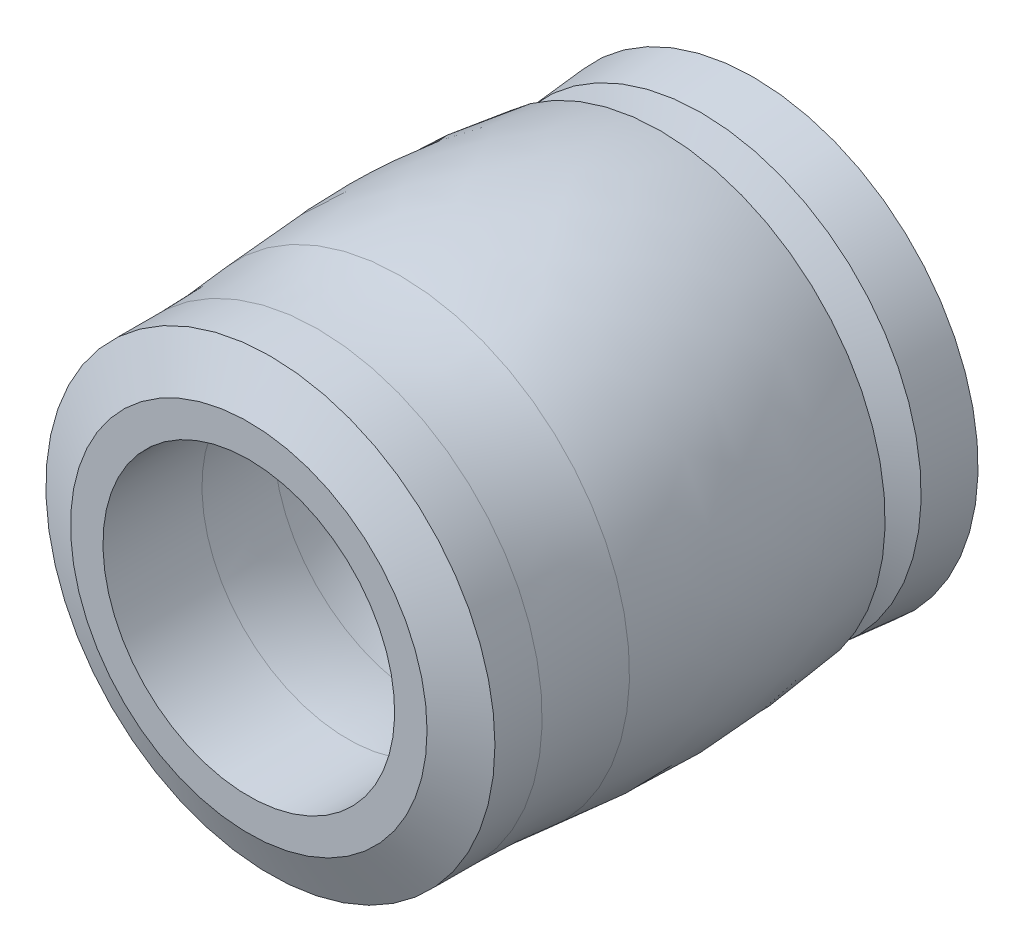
ISO-10303-21;
HEADER;
FILE_DESCRIPTION(('STEP AP214'),'2;1');
FILE_NAME('part.step','',(''),(''),'','','');
FILE_SCHEMA(('AUTOMOTIVE_DESIGN { 1 0 10303 214 1 1 1 1 }'));
ENDSEC;
DATA;
#1=APPLICATION_CONTEXT('core data for automotive mechanical design processes');
#2=APPLICATION_PROTOCOL_DEFINITION('international standard','automotive_design',2000,#1);
#3=PRODUCT_CONTEXT('',#1,'mechanical');
#4=PRODUCT('Part','Part','',(#3));
#5=PRODUCT_RELATED_PRODUCT_CATEGORY('part','',(#4));
#6=PRODUCT_DEFINITION_FORMATION('','',#4);
#7=PRODUCT_DEFINITION_CONTEXT('part definition',#1,'design');
#8=PRODUCT_DEFINITION('design','',#6,#7);
#9=PRODUCT_DEFINITION_SHAPE('','',#8);
#10=(LENGTH_UNIT() NAMED_UNIT(*) SI_UNIT(.MILLI.,.METRE.));
#11=(NAMED_UNIT(*) PLANE_ANGLE_UNIT() SI_UNIT($,.RADIAN.));
#12=(NAMED_UNIT(*) SI_UNIT($,.STERADIAN.) SOLID_ANGLE_UNIT());
#13=UNCERTAINTY_MEASURE_WITH_UNIT(LENGTH_MEASURE(1.E-05),#10,'distance_accuracy_value','');
#14=(GEOMETRIC_REPRESENTATION_CONTEXT(3) GLOBAL_UNCERTAINTY_ASSIGNED_CONTEXT((#13)) GLOBAL_UNIT_ASSIGNED_CONTEXT((#10,
#11,#12)) REPRESENTATION_CONTEXT('',''));
#15=CARTESIAN_POINT('',(0.,0.,0.));
#16=DIRECTION('',(0.,0.,1.));
#17=DIRECTION('',(1.,0.,0.));
#18=AXIS2_PLACEMENT_3D('',#15,#16,#17);
#19=CARTESIAN_POINT('',(0.,0.,6.42112032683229));
#20=DIRECTION('',(0.,0.,-1.));
#21=DIRECTION('',(0.,1.,0.));
#22=AXIS2_PLACEMENT_3D('',#19,#20,#21);
#23=TOROIDAL_SURFACE('',#22,10.033,2.032);
#24=CARTESIAN_POINT('',(0.,0.,6.42112032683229));
#25=DIRECTION('',(0.,0.,-1.));
#26=DIRECTION('',(0.,1.,0.));
#27=AXIS2_PLACEMENT_3D('',#24,#25,#26);
#28=CIRCLE('',#27,8.001);
#29=CARTESIAN_POINT('',(0.,8.001,6.42112032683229));
#30=VERTEX_POINT('',#29);
#31=EDGE_CURVE('E97',#30,#30,#28,.T.);
#32=ORIENTED_EDGE('',*,*,#31,.T.);
#33=EDGE_LOOP('',(#32));
#34=FACE_BOUND('',#33,.T.);
#35=CARTESIAN_POINT('',(0.,0.,6.77912953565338));
#36=DIRECTION('',(0.,0.,-1.));
#37=DIRECTION('',(0.,1.,0.));
#38=AXIS2_PLACEMENT_3D('',#35,#36,#37);
#39=CIRCLE('',#38,8.03278665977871);
#40=CARTESIAN_POINT('',(0.,8.03278665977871,6.77912953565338));
#41=VERTEX_POINT('',#40);
#42=EDGE_CURVE('E153',#41,#41,#39,.F.);
#43=ORIENTED_EDGE('',*,*,#42,.T.);
#44=EDGE_LOOP('',(#43));
#45=FACE_BOUND('',#44,.T.);
#46=ADVANCED_FACE('F12',(#34,#45),#23,.T.);
#47=CARTESIAN_POINT('',(0.,-27.8855979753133,13.208));
#48=DIRECTION('',(1.,0.,0.));
#49=DIRECTION('',(0.,1.,0.));
#50=AXIS2_PLACEMENT_3D('',#47,#48,#49);
#51=CIRCLE('',#50,36.4891864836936);
#52=TRIMMED_CURVE('',#51,(PARAMETER_VALUE(-0.700972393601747)),
(PARAMETER_VALUE(0.700972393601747)),.T.,.PARAMETER.);
#53=CARTESIAN_POINT('',(0.,0.,13.208));
#54=DIRECTION('',(0.,0.,-1.));
#55=AXIS1_PLACEMENT('',#53,#54);
#56=SURFACE_OF_REVOLUTION('',#52,#55);
#57=ORIENTED_EDGE('',*,*,#42,.F.);
#58=EDGE_LOOP('',(#57));
#59=FACE_BOUND('',#58,.T.);
#60=CARTESIAN_POINT('',(0.,0.,18.0465116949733));
#61=DIRECTION('',(0.,0.,-1.));
#62=DIRECTION('',(0.,1.,0.));
#63=AXIS2_PLACEMENT_3D('',#60,#61,#62);
#64=CIRCLE('',#63,8.28136947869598);
#65=CARTESIAN_POINT('',(0.,8.28136947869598,18.0465116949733));
#66=VERTEX_POINT('',#65);
#67=EDGE_CURVE('E94',#66,#66,#64,.T.);
#68=ORIENTED_EDGE('',*,*,#67,.F.);
#69=EDGE_LOOP('',(#68));
#70=FACE_BOUND('',#69,.T.);
#71=ADVANCED_FACE('F101',(#59,#70),#56,.T.);
#72=CARTESIAN_POINT('',(0.,0.,-1.38290540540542));
#73=DIRECTION('',(0.,0.,-1.));
#74=DIRECTION('',(0.,1.,0.));
#75=AXIS2_PLACEMENT_3D('',#72,#73,#74);
#76=CYLINDRICAL_SURFACE('',#75,8.001);
#77=CARTESIAN_POINT('',(0.,0.,6.15635149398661));
#78=DIRECTION('',(0.,0.,1.));
#79=DIRECTION('',(0.,-1.,0.));
#80=AXIS2_PLACEMENT_3D('',#77,#78,#79);
#81=CIRCLE('',#80,8.001);
#82=CARTESIAN_POINT('',(0.,-8.001,6.15635149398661));
#83=VERTEX_POINT('',#82);
#84=EDGE_CURVE('E91',#83,#83,#81,.F.);
#85=ORIENTED_EDGE('',*,*,#84,.T.);
#86=EDGE_LOOP('',(#85));
#87=FACE_BOUND('',#86,.T.);
#88=ORIENTED_EDGE('',*,*,#31,.F.);
#89=EDGE_LOOP('',(#88));
#90=FACE_BOUND('',#89,.T.);
#91=ADVANCED_FACE('F84',(#87,#90),#76,.F.);
#92=CARTESIAN_POINT('',(0.,0.,22.2566013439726));
#93=DIRECTION('',(0.,0.,-1.));
#94=DIRECTION('',(0.,1.,0.));
#95=AXIS2_PLACEMENT_3D('',#92,#93,#94);
#96=TOROIDAL_SURFACE('',#95,39.751,31.75);
#97=ORIENTED_EDGE('',*,*,#67,.T.);
#98=EDGE_LOOP('',(#97));
#99=FACE_BOUND('',#98,.T.);
#100=CARTESIAN_POINT('',(0.,0.,22.2566013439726));
#101=DIRECTION('',(0.,0.,-1.));
#102=DIRECTION('',(0.,1.,0.));
#103=AXIS2_PLACEMENT_3D('',#100,#101,#102);
#104=CIRCLE('',#103,8.001);
#105=CARTESIAN_POINT('',(0.,8.001,22.2566013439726));
#106=VERTEX_POINT('',#105);
#107=EDGE_CURVE('E89',#106,#106,#104,.F.);
#108=ORIENTED_EDGE('',*,*,#107,.T.);
#109=EDGE_LOOP('',(#108));
#110=FACE_BOUND('',#109,.T.);
#111=ADVANCED_FACE('F79',(#99,#110),#96,.T.);
#112=CARTESIAN_POINT('',(0.,0.,6.15635149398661));
#113=DIRECTION('',(0.,0.,1.));
#114=DIRECTION('',(-1.,0.,0.));
#115=AXIS2_PLACEMENT_3D('',#112,#113,#114);
#116=CONICAL_SURFACE('',#115,8.001,1.0471975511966);
#117=ORIENTED_EDGE('',*,*,#84,.F.);
#118=EDGE_LOOP('',(#117));
#119=FACE_BOUND('',#118,.T.);
#120=CARTESIAN_POINT('',(0.,0.,3.81));
#121=DIRECTION('',(0.,0.,-1.));
#122=DIRECTION('',(0.,1.,0.));
#123=AXIS2_PLACEMENT_3D('',#120,#121,#122);
#124=CIRCLE('',#123,3.937);
#125=CARTESIAN_POINT('',(0.,3.937,3.81));
#126=VERTEX_POINT('',#125);
#127=EDGE_CURVE('E133',#126,#126,#124,.T.);
#128=ORIENTED_EDGE('',*,*,#127,.T.);
#129=EDGE_LOOP('',(#128));
#130=FACE_BOUND('',#129,.T.);
#131=ADVANCED_FACE('F75',(#119,#130),#116,.F.);
#132=CARTESIAN_POINT('',(0.,0.,-1.38290540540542));
#133=DIRECTION('',(0.,0.,-1.));
#134=DIRECTION('',(0.,1.,0.));
#135=AXIS2_PLACEMENT_3D('',#132,#133,#134);
#136=CYLINDRICAL_SURFACE('',#135,8.001);
#137=ORIENTED_EDGE('',*,*,#107,.F.);
#138=EDGE_LOOP('',(#137));
#139=FACE_BOUND('',#138,.T.);
#140=CARTESIAN_POINT('',(0.,0.,27.686));
#141=DIRECTION('',(0.,0.,-1.));
#142=DIRECTION('',(0.,1.,0.));
#143=AXIS2_PLACEMENT_3D('',#140,#141,#142);
#144=CIRCLE('',#143,8.001);
#145=CARTESIAN_POINT('',(0.,8.001,27.686));
#146=VERTEX_POINT('',#145);
#147=EDGE_CURVE('E16',#146,#146,#144,.T.);
#148=ORIENTED_EDGE('',*,*,#147,.F.);
#149=EDGE_LOOP('',(#148));
#150=FACE_BOUND('',#149,.T.);
#151=ADVANCED_FACE('F71',(#139,#150),#136,.F.);
#152=CARTESIAN_POINT('',(0.,0.,-1.38290540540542));
#153=DIRECTION('',(0.,0.,-1.));
#154=DIRECTION('',(0.,1.,0.));
#155=AXIS2_PLACEMENT_3D('',#152,#153,#154);
#156=CYLINDRICAL_SURFACE('',#155,3.937);
#157=CARTESIAN_POINT('',(0.,0.,0.));
#158=DIRECTION('',(0.,0.,-1.));
#159=DIRECTION('',(0.,1.,0.));
#160=AXIS2_PLACEMENT_3D('',#157,#158,#159);
#161=CIRCLE('',#160,3.937);
#162=CARTESIAN_POINT('',(0.,3.937,0.));
#163=VERTEX_POINT('',#162);
#164=EDGE_CURVE('E138',#163,#163,#161,.F.);
#165=ORIENTED_EDGE('',*,*,#164,.F.);
#166=EDGE_LOOP('',(#165));
#167=FACE_BOUND('',#166,.T.);
#168=ORIENTED_EDGE('',*,*,#127,.F.);
#169=EDGE_LOOP('',(#168));
#170=FACE_BOUND('',#169,.T.);
#171=ADVANCED_FACE('F67',(#167,#170),#156,.F.);
#172=CARTESIAN_POINT('',(9.779,0.,27.686));
#173=DIRECTION('',(0.,0.,1.));
#174=DIRECTION('',(0.,-1.,0.));
#175=AXIS2_PLACEMENT_3D('',#172,#173,#174);
#176=PLANE('',#175);
#177=CARTESIAN_POINT('',(0.,0.,27.686));
#178=DIRECTION('',(0.,0.,-1.));
#179=DIRECTION('',(1.,0.,0.));
#180=AXIS2_PLACEMENT_3D('',#177,#178,#179);
#181=CIRCLE('',#180,9.779);
#182=CARTESIAN_POINT('',(9.779,0.,27.686));
#183=VERTEX_POINT('',#182);
#184=EDGE_CURVE('E146',#183,#183,#181,.T.);
#185=ORIENTED_EDGE('',*,*,#184,.F.);
#186=EDGE_LOOP('',(#185));
#187=FACE_BOUND('',#186,.T.);
#188=ORIENTED_EDGE('',*,*,#147,.T.);
#189=EDGE_LOOP('',(#188));
#190=FACE_BOUND('',#189,.T.);
#191=ADVANCED_FACE('F63',(#187,#190),#176,.T.);
#192=CARTESIAN_POINT('',(3.937,0.,0.));
#193=DIRECTION('',(0.,0.,-1.));
#194=DIRECTION('',(0.,1.,0.));
#195=AXIS2_PLACEMENT_3D('',#192,#193,#194);
#196=PLANE('',#195);
#197=ORIENTED_EDGE('',*,*,#164,.T.);
#198=EDGE_LOOP('',(#197));
#199=FACE_BOUND('',#198,.T.);
#200=CARTESIAN_POINT('',(0.,0.,0.));
#201=DIRECTION('',(0.,0.,-1.));
#202=DIRECTION('',(0.,1.,0.));
#203=AXIS2_PLACEMENT_3D('',#200,#201,#202);
#204=CIRCLE('',#203,12.319);
#205=CARTESIAN_POINT('',(0.,12.319,0.));
#206=VERTEX_POINT('',#205);
#207=EDGE_CURVE('E132',#206,#206,#204,.F.);
#208=ORIENTED_EDGE('',*,*,#207,.F.);
#209=EDGE_LOOP('',(#208));
#210=FACE_BOUND('',#209,.T.);
#211=ADVANCED_FACE('F59',(#199,#210),#196,.T.);
#212=CARTESIAN_POINT('',(0.,0.,26.5015785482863));
#213=DIRECTION('',(0.,0.,-1.));
#214=DIRECTION('',(1.,0.,0.));
#215=AXIS2_PLACEMENT_3D('',#212,#213,#214);
#216=CONICAL_SURFACE('',#215,12.319,1.13446401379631);
#217=CARTESIAN_POINT('',(0.,0.,26.5015785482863));
#218=DIRECTION('',(0.,0.,-1.));
#219=DIRECTION('',(0.,1.,0.));
#220=AXIS2_PLACEMENT_3D('',#217,#218,#219);
#221=CIRCLE('',#220,12.319);
#222=CARTESIAN_POINT('',(0.,12.319,26.5015785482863));
#223=VERTEX_POINT('',#222);
#224=EDGE_CURVE('E128',#223,#223,#221,.T.);
#225=ORIENTED_EDGE('',*,*,#224,.F.);
#226=EDGE_LOOP('',(#225));
#227=FACE_BOUND('',#226,.T.);
#228=ORIENTED_EDGE('',*,*,#184,.T.);
#229=EDGE_LOOP('',(#228));
#230=FACE_BOUND('',#229,.T.);
#231=ADVANCED_FACE('F55',(#227,#230),#216,.T.);
#232=CARTESIAN_POINT('',(0.,0.,0.));
#233=DIRECTION('',(0.,0.,-1.));
#234=DIRECTION('',(0.,1.,0.));
#235=AXIS2_PLACEMENT_3D('',#232,#233,#234);
#236=CONICAL_SURFACE('',#235,12.319,0.0872664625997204);
#237=ORIENTED_EDGE('',*,*,#207,.T.);
#238=EDGE_LOOP('',(#237));
#239=FACE_BOUND('',#238,.T.);
#240=CARTESIAN_POINT('',(0.,0.,2.86965063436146));
#241=DIRECTION('',(0.,0.,-1.));
#242=DIRECTION('',(0.,1.,0.));
#243=AXIS2_PLACEMENT_3D('',#240,#241,#242);
#244=CIRCLE('',#243,12.0679381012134);
#245=CARTESIAN_POINT('',(0.,12.0679381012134,2.86965063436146));
#246=VERTEX_POINT('',#245);
#247=EDGE_CURVE('E126',#246,#246,#244,.F.);
#248=ORIENTED_EDGE('',*,*,#247,.F.);
#249=EDGE_LOOP('',(#248));
#250=FACE_BOUND('',#249,.T.);
#251=ADVANCED_FACE('F51',(#239,#250),#236,.T.);
#252=CARTESIAN_POINT('',(0.,0.,-1.38290540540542));
#253=DIRECTION('',(0.,0.,-1.));
#254=DIRECTION('',(0.,1.,0.));
#255=AXIS2_PLACEMENT_3D('',#252,#253,#254);
#256=CYLINDRICAL_SURFACE('',#255,12.319);
#257=CARTESIAN_POINT('',(0.,0.,23.9111795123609));
#258=DIRECTION('',(0.,0.,-1.));
#259=DIRECTION('',(0.,1.,0.));
#260=AXIS2_PLACEMENT_3D('',#257,#258,#259);
#261=CIRCLE('',#260,12.319);
#262=CARTESIAN_POINT('',(0.,12.319,23.9111795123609));
#263=VERTEX_POINT('',#262);
#264=EDGE_CURVE('E32',#263,#263,#261,.F.);
#265=ORIENTED_EDGE('',*,*,#264,.T.);
#266=EDGE_LOOP('',(#265));
#267=FACE_BOUND('',#266,.T.);
#268=ORIENTED_EDGE('',*,*,#224,.T.);
#269=EDGE_LOOP('',(#268));
#270=FACE_BOUND('',#269,.T.);
#271=ADVANCED_FACE('F47',(#267,#270),#256,.T.);
#272=CARTESIAN_POINT('',(0.,0.,2.86965063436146));
#273=DIRECTION('',(0.,0.,-1.));
#274=DIRECTION('',(1.,0.,0.));
#275=AXIS2_PLACEMENT_3D('',#272,#273,#274);
#276=CONICAL_SURFACE('',#275,12.0679381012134,1.13446401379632);
#277=ORIENTED_EDGE('',*,*,#247,.T.);
#278=EDGE_LOOP('',(#277));
#279=FACE_BOUND('',#278,.T.);
#280=CARTESIAN_POINT('',(0.,0.,3.937));
#281=DIRECTION('',(0.,0.,1.));
#282=DIRECTION('',(0.,-1.,0.));
#283=AXIS2_PLACEMENT_3D('',#280,#281,#282);
#284=CIRCLE('',#283,9.779);
#285=CARTESIAN_POINT('',(0.,-9.779,3.937));
#286=VERTEX_POINT('',#285);
#287=EDGE_CURVE('E25',#286,#286,#284,.T.);
#288=ORIENTED_EDGE('',*,*,#287,.F.);
#289=EDGE_LOOP('',(#288));
#290=FACE_BOUND('',#289,.T.);
#291=ADVANCED_FACE('F42',(#279,#290),#276,.T.);
#292=CARTESIAN_POINT('',(0.,0.,23.9111795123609));
#293=DIRECTION('',(0.,0.,-1.));
#294=DIRECTION('',(0.,1.,0.));
#295=AXIS2_PLACEMENT_3D('',#292,#293,#294);
#296=TOROIDAL_SURFACE('',#295,50.419,38.1);
#297=CARTESIAN_POINT('',(0.,0.,19.3889297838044));
#298=DIRECTION('',(0.,0.,-1.));
#299=DIRECTION('',(0.,1.,0.));
#300=AXIS2_PLACEMENT_3D('',#297,#298,#299);
#301=CIRCLE('',#300,12.5883344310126);
#302=CARTESIAN_POINT('',(0.,12.5883344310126,19.3889297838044));
#303=VERTEX_POINT('',#302);
#304=EDGE_CURVE('E20',#303,#303,#301,.T.);
#305=ORIENTED_EDGE('',*,*,#304,.F.);
#306=EDGE_LOOP('',(#305));
#307=FACE_BOUND('',#306,.T.);
#308=ORIENTED_EDGE('',*,*,#264,.F.);
#309=EDGE_LOOP('',(#308));
#310=FACE_BOUND('',#309,.T.);
#311=ADVANCED_FACE('F37',(#307,#310),#296,.F.);
#312=CARTESIAN_POINT('',(0.,0.,5.10032835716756));
#313=DIRECTION('',(0.,0.,1.));
#314=DIRECTION('',(0.,-1.,0.));
#315=AXIS2_PLACEMENT_3D('',#312,#313,#314);
#316=CONICAL_SURFACE('',#315,12.3214259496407,1.14166813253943);
#317=CARTESIAN_POINT('',(0.,0.,5.10032835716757));
#318=DIRECTION('',(0.,0.,-1.));
#319=DIRECTION('',(0.,1.,0.));
#320=AXIS2_PLACEMENT_3D('',#317,#318,#319);
#321=CIRCLE('',#320,12.3214259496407);
#322=CARTESIAN_POINT('',(0.,12.3214259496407,5.10032835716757));
#323=VERTEX_POINT('',#322);
#324=EDGE_CURVE('E8',#323,#323,#321,.F.);
#325=ORIENTED_EDGE('',*,*,#324,.F.);
#326=EDGE_LOOP('',(#325));
#327=FACE_BOUND('',#326,.T.);
#328=ORIENTED_EDGE('',*,*,#287,.T.);
#329=EDGE_LOOP('',(#328));
#330=FACE_BOUND('',#329,.T.);
#331=ADVANCED_FACE('F41',(#327,#330),#316,.T.);
#332=CARTESIAN_POINT('',(0.,-39.1179404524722,13.208));
#333=DIRECTION('',(1.,0.,0.));
#334=DIRECTION('',(0.,1.,0.));
#335=AXIS2_PLACEMENT_3D('',#332,#333,#334);
#336=CIRCLE('',#335,52.0743963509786);
#337=TRIMMED_CURVE('',#336,(PARAMETER_VALUE(-0.720928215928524)),
(PARAMETER_VALUE(0.720928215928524)),.T.,.PARAMETER.);
#338=CARTESIAN_POINT('',(0.,0.,13.208));
#339=DIRECTION('',(0.,0.,-1.));
#340=AXIS1_PLACEMENT('',#338,#339);
#341=SURFACE_OF_REVOLUTION('',#337,#340);
#342=ORIENTED_EDGE('',*,*,#324,.T.);
#343=EDGE_LOOP('',(#342));
#344=FACE_BOUND('',#343,.T.);
#345=ORIENTED_EDGE('',*,*,#304,.T.);
#346=EDGE_LOOP('',(#345));
#347=FACE_BOUND('',#346,.T.);
#348=ADVANCED_FACE('F114',(#344,#347),#341,.F.);
#349=CLOSED_SHELL('',(#46,#71,#91,#111,#131,#151,#171,#191,#211,#231,#251,#271,#291,#311,#331,#348));
#350=MANIFOLD_SOLID_BREP('B1',#349);
#351=ADVANCED_BREP_SHAPE_REPRESENTATION('',(#18,#350),#14);
#352=SHAPE_DEFINITION_REPRESENTATION(#9,#351);
ENDSEC;
END-ISO-10303-21;
